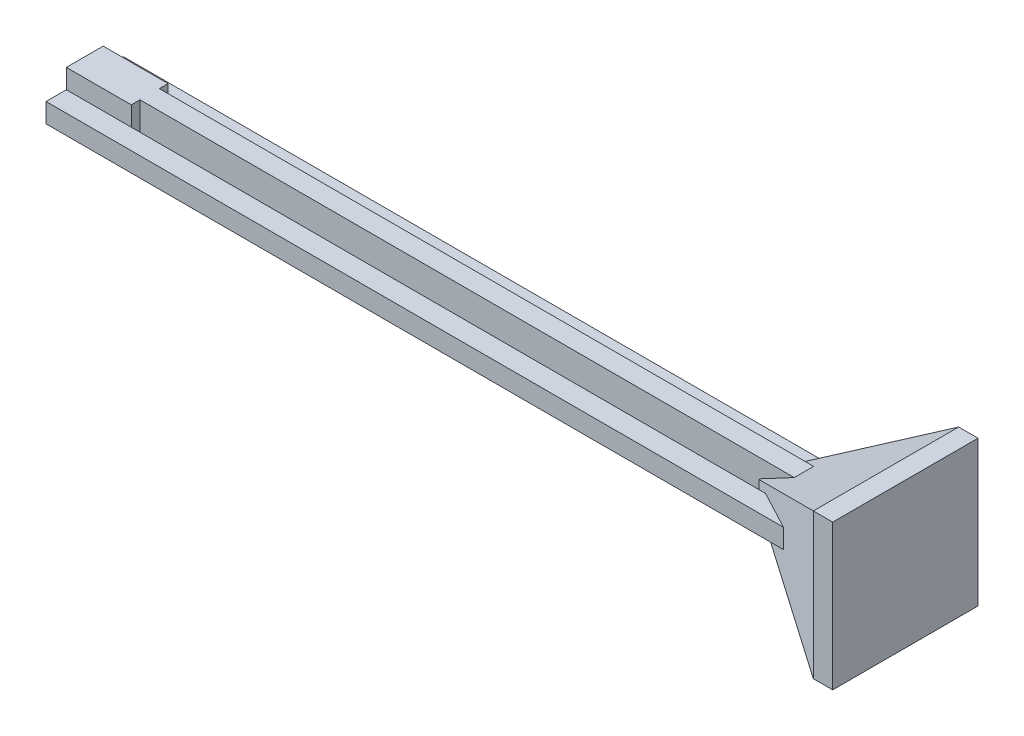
ISO-10303-21;
HEADER;
FILE_DESCRIPTION(('STEP AP214'),'2;1');
FILE_NAME('part.step','',(''),(''),'','','');
FILE_SCHEMA(('AUTOMOTIVE_DESIGN { 1 0 10303 214 1 1 1 1 }'));
ENDSEC;
DATA;
#1=APPLICATION_CONTEXT('core data for automotive mechanical design processes');
#2=APPLICATION_PROTOCOL_DEFINITION('international standard','automotive_design',2000,#1);
#3=PRODUCT_CONTEXT('',#1,'mechanical');
#4=PRODUCT('Part','Part','',(#3));
#5=PRODUCT_RELATED_PRODUCT_CATEGORY('part','',(#4));
#6=PRODUCT_DEFINITION_FORMATION('','',#4);
#7=PRODUCT_DEFINITION_CONTEXT('part definition',#1,'design');
#8=PRODUCT_DEFINITION('design','',#6,#7);
#9=PRODUCT_DEFINITION_SHAPE('','',#8);
#10=(LENGTH_UNIT() NAMED_UNIT(*) SI_UNIT(.MILLI.,.METRE.));
#11=(NAMED_UNIT(*) PLANE_ANGLE_UNIT() SI_UNIT($,.RADIAN.));
#12=(NAMED_UNIT(*) SI_UNIT($,.STERADIAN.) SOLID_ANGLE_UNIT());
#13=UNCERTAINTY_MEASURE_WITH_UNIT(LENGTH_MEASURE(1.E-05),#10,'distance_accuracy_value','');
#14=(GEOMETRIC_REPRESENTATION_CONTEXT(3) GLOBAL_UNCERTAINTY_ASSIGNED_CONTEXT((#13)) GLOBAL_UNIT_ASSIGNED_CONTEXT((#10,
#11,#12)) REPRESENTATION_CONTEXT('',''));
#15=CARTESIAN_POINT('',(0.,0.,0.));
#16=DIRECTION('',(0.,0.,1.));
#17=DIRECTION('',(1.,0.,0.));
#18=AXIS2_PLACEMENT_3D('',#15,#16,#17);
#19=CARTESIAN_POINT('',(-3.35,4.,1.9));
#20=DIRECTION('',(0.,0.,-1.));
#21=DIRECTION('',(-1.,0.,0.));
#22=AXIS2_PLACEMENT_3D('',#19,#20,#21);
#23=PLANE('',#22);
#24=DIRECTION('',(-1.,0.,0.));
#25=VECTOR('',#24,1.);
#26=CARTESIAN_POINT('',(74.65,4.,1.9));
#27=LINE('',#26,#25);
#28=CARTESIAN_POINT('',(3.35000000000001,4.,1.9));
#29=VERTEX_POINT('',#28);
#30=CARTESIAN_POINT('',(-3.35,4.,1.9));
#31=VERTEX_POINT('',#30);
#32=EDGE_CURVE('E272',#29,#31,#27,.T.);
#33=ORIENTED_EDGE('',*,*,#32,.F.);
#34=DIRECTION('',(0.,-1.,0.));
#35=VECTOR('',#34,1.);
#36=CARTESIAN_POINT('',(3.35,4.,1.9));
#37=LINE('',#36,#35);
#38=CARTESIAN_POINT('',(3.35,6.,1.9));
#39=VERTEX_POINT('',#38);
#40=EDGE_CURVE('E415',#39,#29,#37,.T.);
#41=ORIENTED_EDGE('',*,*,#40,.F.);
#42=DIRECTION('',(1.,0.,0.));
#43=VECTOR('',#42,1.);
#44=CARTESIAN_POINT('',(-7.64418211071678,6.,1.9));
#45=LINE('',#44,#43);
#46=CARTESIAN_POINT('',(-3.35,6.,1.9));
#47=VERTEX_POINT('',#46);
#48=EDGE_CURVE('E359',#47,#39,#45,.T.);
#49=ORIENTED_EDGE('',*,*,#48,.F.);
#50=DIRECTION('',(0.,-1.,0.));
#51=VECTOR('',#50,1.);
#52=CARTESIAN_POINT('',(-3.35,4.,1.9));
#53=LINE('',#52,#51);
#54=EDGE_CURVE('E419',#47,#31,#53,.T.);
#55=ORIENTED_EDGE('',*,*,#54,.T.);
#56=EDGE_LOOP('',(#33,#41,#49,#55));
#57=FACE_BOUND('',#56,.T.);
#58=ADVANCED_FACE('F32',(#57),#23,.F.);
#59=CARTESIAN_POINT('',(-3.35,4.,-1.9));
#60=DIRECTION('',(0.,0.,1.));
#61=DIRECTION('',(1.,0.,0.));
#62=AXIS2_PLACEMENT_3D('',#59,#60,#61);
#63=PLANE('',#62);
#64=DIRECTION('',(-1.,0.,0.));
#65=VECTOR('',#64,1.);
#66=CARTESIAN_POINT('',(74.65,2.,-1.9));
#67=LINE('',#66,#65);
#68=CARTESIAN_POINT('',(3.35000000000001,2.,-1.9));
#69=VERTEX_POINT('',#68);
#70=CARTESIAN_POINT('',(-3.35,2.,-1.9));
#71=VERTEX_POINT('',#70);
#72=EDGE_CURVE('E290',#69,#71,#67,.T.);
#73=ORIENTED_EDGE('',*,*,#72,.F.);
#74=DIRECTION('',(0.,-1.,0.));
#75=VECTOR('',#74,1.);
#76=CARTESIAN_POINT('',(3.35,4.,-1.9));
#77=LINE('',#76,#75);
#78=CARTESIAN_POINT('',(3.35,0.,-1.9));
#79=VERTEX_POINT('',#78);
#80=EDGE_CURVE('E426',#69,#79,#77,.T.);
#81=ORIENTED_EDGE('',*,*,#80,.T.);
#82=DIRECTION('',(-1.,0.,0.));
#83=VECTOR('',#82,1.);
#84=CARTESIAN_POINT('',(-3.35,0.,-1.9));
#85=LINE('',#84,#83);
#86=CARTESIAN_POINT('',(-3.35,0.,-1.9));
#87=VERTEX_POINT('',#86);
#88=EDGE_CURVE('E405',#79,#87,#85,.T.);
#89=ORIENTED_EDGE('',*,*,#88,.T.);
#90=DIRECTION('',(0.,-1.,0.));
#91=VECTOR('',#90,1.);
#92=CARTESIAN_POINT('',(-3.35,4.,-1.9));
#93=LINE('',#92,#91);
#94=EDGE_CURVE('E422',#71,#87,#93,.T.);
#95=ORIENTED_EDGE('',*,*,#94,.F.);
#96=EDGE_LOOP('',(#73,#81,#89,#95));
#97=FACE_BOUND('',#96,.T.);
#98=ADVANCED_FACE('F510',(#97),#63,.F.);
#99=CARTESIAN_POINT('',(3.35,4.,-1.9));
#100=DIRECTION('',(-1.,0.,0.));
#101=DIRECTION('',(0.,0.,1.));
#102=AXIS2_PLACEMENT_3D('',#99,#100,#101);
#103=PLANE('',#102);
#104=DIRECTION('',(0.,-1.,0.));
#105=VECTOR('',#104,1.);
#106=CARTESIAN_POINT('',(3.35,6.,1.));
#107=LINE('',#106,#105);
#108=CARTESIAN_POINT('',(3.35,6.,1.));
#109=VERTEX_POINT('',#108);
#110=CARTESIAN_POINT('',(3.35,0.,1.));
#111=VERTEX_POINT('',#110);
#112=EDGE_CURVE('E340',#109,#111,#107,.T.);
#113=ORIENTED_EDGE('',*,*,#112,.F.);
#114=DIRECTION('',(0.,0.,1.));
#115=VECTOR('',#114,1.);
#116=CARTESIAN_POINT('',(3.35,6.,1.9));
#117=LINE('',#116,#115);
#118=EDGE_CURVE('E354',#109,#39,#117,.T.);
#119=ORIENTED_EDGE('',*,*,#118,.T.);
#120=ORIENTED_EDGE('',*,*,#40,.T.);
#121=CARTESIAN_POINT('',(3.35000000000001,2.,1.9));
#122=VERTEX_POINT('',#121);
#123=EDGE_CURVE('E267',#29,#122,#37,.T.);
#124=ORIENTED_EDGE('',*,*,#123,.T.);
#125=CARTESIAN_POINT('',(3.35,0.,1.9));
#126=VERTEX_POINT('',#125);
#127=EDGE_CURVE('E414',#122,#126,#37,.T.);
#128=ORIENTED_EDGE('',*,*,#127,.T.);
#129=DIRECTION('',(0.,0.,-1.));
#130=VECTOR('',#129,1.);
#131=CARTESIAN_POINT('',(3.35,0.,-1.9));
#132=LINE('',#131,#130);
#133=EDGE_CURVE('E402',#126,#111,#132,.T.);
#134=ORIENTED_EDGE('',*,*,#133,.T.);
#135=EDGE_LOOP('',(#113,#119,#120,#124,#128,#134));
#136=FACE_BOUND('',#135,.T.);
#137=ADVANCED_FACE('F34',(#136),#103,.F.);
#138=DIRECTION('',(0.,1.,0.));
#139=VECTOR('',#138,1.);
#140=CARTESIAN_POINT('',(3.35,0.,-1.));
#141=LINE('',#140,#139);
#142=CARTESIAN_POINT('',(3.35,0.,-1.));
#143=VERTEX_POINT('',#142);
#144=CARTESIAN_POINT('',(3.35,6.,-1.));
#145=VERTEX_POINT('',#144);
#146=EDGE_CURVE('E343',#143,#145,#141,.T.);
#147=ORIENTED_EDGE('',*,*,#146,.F.);
#148=EDGE_CURVE('E401',#143,#79,#132,.T.);
#149=ORIENTED_EDGE('',*,*,#148,.T.);
#150=ORIENTED_EDGE('',*,*,#80,.F.);
#151=CARTESIAN_POINT('',(3.35000000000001,4.,-1.9));
#152=VERTEX_POINT('',#151);
#153=EDGE_CURVE('E298',#152,#69,#77,.T.);
#154=ORIENTED_EDGE('',*,*,#153,.F.);
#155=CARTESIAN_POINT('',(3.35,6.,-1.9));
#156=VERTEX_POINT('',#155);
#157=EDGE_CURVE('E427',#156,#152,#77,.T.);
#158=ORIENTED_EDGE('',*,*,#157,.F.);
#159=EDGE_CURVE('E360',#156,#145,#117,.T.);
#160=ORIENTED_EDGE('',*,*,#159,.T.);
#161=EDGE_LOOP('',(#147,#149,#150,#154,#158,#160));
#162=FACE_BOUND('',#161,.T.);
#163=ADVANCED_FACE('F506',(#162),#103,.F.);
#164=CARTESIAN_POINT('',(0.,0.,0.));
#165=DIRECTION('',(0.,1.,0.));
#166=DIRECTION('',(0.,0.,1.));
#167=AXIS2_PLACEMENT_3D('',#164,#165,#166);
#168=PLANE('',#167);
#169=DIRECTION('',(-1.,0.,0.));
#170=VECTOR('',#169,1.);
#171=CARTESIAN_POINT('',(79.35,0.,-1.));
#172=LINE('',#171,#170);
#173=CARTESIAN_POINT('',(70.8867309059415,0.,-1.));
#174=VERTEX_POINT('',#173);
#175=EDGE_CURVE('E350',#174,#143,#172,.T.);
#176=ORIENTED_EDGE('',*,*,#175,.F.);
#177=DIRECTION('',(0.,0.,1.));
#178=VECTOR('',#177,1.);
#179=CARTESIAN_POINT('',(70.8867309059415,0.,0.));
#180=LINE('',#179,#178);
#181=CARTESIAN_POINT('',(70.8867309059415,0.,1.));
#182=VERTEX_POINT('',#181);
#183=EDGE_CURVE('E336',#174,#182,#180,.T.);
#184=ORIENTED_EDGE('',*,*,#183,.T.);
#185=DIRECTION('',(-1.,0.,0.));
#186=VECTOR('',#185,1.);
#187=CARTESIAN_POINT('',(79.35,0.,1.));
#188=LINE('',#187,#186);
#189=EDGE_CURVE('E352',#182,#111,#188,.T.);
#190=ORIENTED_EDGE('',*,*,#189,.T.);
#191=ORIENTED_EDGE('',*,*,#133,.F.);
#192=DIRECTION('',(1.,0.,0.));
#193=VECTOR('',#192,1.);
#194=CARTESIAN_POINT('',(-3.35,0.,1.9));
#195=LINE('',#194,#193);
#196=CARTESIAN_POINT('',(-3.35,0.,1.9));
#197=VERTEX_POINT('',#196);
#198=EDGE_CURVE('E411',#197,#126,#195,.T.);
#199=ORIENTED_EDGE('',*,*,#198,.F.);
#200=DIRECTION('',(0.,0.,1.));
#201=VECTOR('',#200,1.);
#202=CARTESIAN_POINT('',(-3.35,0.,-1.9));
#203=LINE('',#202,#201);
#204=EDGE_CURVE('E408',#87,#197,#203,.T.);
#205=ORIENTED_EDGE('',*,*,#204,.F.);
#206=ORIENTED_EDGE('',*,*,#88,.F.);
#207=ORIENTED_EDGE('',*,*,#148,.F.);
#208=EDGE_LOOP('',(#176,#184,#190,#191,#199,#205,#206,#207));
#209=FACE_BOUND('',#208,.T.);
#210=DIRECTION('',(0.,0.,-1.));
#211=VECTOR('',#210,1.);
#212=CARTESIAN_POINT('',(2.15,0.,-0.7));
#213=LINE('',#212,#211);
#214=CARTESIAN_POINT('',(2.15,0.,0.7));
#215=VERTEX_POINT('',#214);
#216=CARTESIAN_POINT('',(2.15,0.,-0.7));
#217=VERTEX_POINT('',#216);
#218=EDGE_CURVE('E358',#215,#217,#213,.T.);
#219=ORIENTED_EDGE('',*,*,#218,.T.);
#220=DIRECTION('',(-1.,0.,0.));
#221=VECTOR('',#220,1.);
#222=CARTESIAN_POINT('',(-2.15,0.,-0.7));
#223=LINE('',#222,#221);
#224=CARTESIAN_POINT('',(-2.15,0.,-0.7));
#225=VERTEX_POINT('',#224);
#226=EDGE_CURVE('E384',#217,#225,#223,.T.);
#227=ORIENTED_EDGE('',*,*,#226,.T.);
#228=DIRECTION('',(0.,0.,1.));
#229=VECTOR('',#228,1.);
#230=CARTESIAN_POINT('',(-2.15,0.,-0.7));
#231=LINE('',#230,#229);
#232=CARTESIAN_POINT('',(-2.15,0.,0.7));
#233=VERTEX_POINT('',#232);
#234=EDGE_CURVE('E387',#225,#233,#231,.T.);
#235=ORIENTED_EDGE('',*,*,#234,.T.);
#236=DIRECTION('',(1.,0.,0.));
#237=VECTOR('',#236,1.);
#238=CARTESIAN_POINT('',(-2.15,0.,0.7));
#239=LINE('',#238,#237);
#240=EDGE_CURVE('E372',#233,#215,#239,.T.);
#241=ORIENTED_EDGE('',*,*,#240,.T.);
#242=EDGE_LOOP('',(#219,#227,#235,#241));
#243=FACE_BOUND('',#242,.T.);
#244=ADVANCED_FACE('F516',(#209,#243),#168,.F.);
#245=ORIENTED_EDGE('',*,*,#157,.T.);
#246=DIRECTION('',(-1.,0.,0.));
#247=VECTOR('',#246,1.);
#248=CARTESIAN_POINT('',(74.65,4.,-1.9));
#249=LINE('',#248,#247);
#250=CARTESIAN_POINT('',(-3.35,4.,-1.9));
#251=VERTEX_POINT('',#250);
#252=EDGE_CURVE('E285',#152,#251,#249,.T.);
#253=ORIENTED_EDGE('',*,*,#252,.T.);
#254=CARTESIAN_POINT('',(-3.35,6.,-1.9));
#255=VERTEX_POINT('',#254);
#256=EDGE_CURVE('E423',#255,#251,#93,.T.);
#257=ORIENTED_EDGE('',*,*,#256,.F.);
#258=DIRECTION('',(1.,0.,0.));
#259=VECTOR('',#258,1.);
#260=CARTESIAN_POINT('',(-7.64418211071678,6.,-1.9));
#261=LINE('',#260,#259);
#262=EDGE_CURVE('E363',#255,#156,#261,.T.);
#263=ORIENTED_EDGE('',*,*,#262,.T.);
#264=EDGE_LOOP('',(#245,#253,#257,#263));
#265=FACE_BOUND('',#264,.T.);
#266=ADVANCED_FACE('F493',(#265),#63,.F.);
#267=CARTESIAN_POINT('',(-3.35,4.,-1.9));
#268=DIRECTION('',(1.,0.,0.));
#269=DIRECTION('',(0.,0.,-1.));
#270=AXIS2_PLACEMENT_3D('',#267,#268,#269);
#271=PLANE('',#270);
#272=ORIENTED_EDGE('',*,*,#204,.T.);
#273=CARTESIAN_POINT('',(-3.35,2.,1.9));
#274=VERTEX_POINT('',#273);
#275=EDGE_CURVE('E418',#274,#197,#53,.T.);
#276=ORIENTED_EDGE('',*,*,#275,.F.);
#277=DIRECTION('',(0.,0.,1.));
#278=VECTOR('',#277,1.);
#279=CARTESIAN_POINT('',(-3.35,2.,4.));
#280=LINE('',#279,#278);
#281=CARTESIAN_POINT('',(-3.35,2.,4.));
#282=VERTEX_POINT('',#281);
#283=EDGE_CURVE('E47',#274,#282,#280,.T.);
#284=ORIENTED_EDGE('',*,*,#283,.T.);
#285=DIRECTION('',(0.,1.,0.));
#286=VECTOR('',#285,1.);
#287=CARTESIAN_POINT('',(-3.35,2.,4.));
#288=LINE('',#287,#286);
#289=CARTESIAN_POINT('',(-3.35,4.,4.));
#290=VERTEX_POINT('',#289);
#291=EDGE_CURVE('E252',#282,#290,#288,.T.);
#292=ORIENTED_EDGE('',*,*,#291,.T.);
#293=DIRECTION('',(0.,0.,-1.));
#294=VECTOR('',#293,1.);
#295=CARTESIAN_POINT('',(-3.35,4.,4.));
#296=LINE('',#295,#294);
#297=EDGE_CURVE('E255',#290,#31,#296,.T.);
#298=ORIENTED_EDGE('',*,*,#297,.T.);
#299=ORIENTED_EDGE('',*,*,#54,.F.);
#300=DIRECTION('',(0.,0.,-1.));
#301=VECTOR('',#300,1.);
#302=CARTESIAN_POINT('',(-3.35,6.,1.9));
#303=LINE('',#302,#301);
#304=EDGE_CURVE('E355',#47,#255,#303,.T.);
#305=ORIENTED_EDGE('',*,*,#304,.T.);
#306=ORIENTED_EDGE('',*,*,#256,.T.);
#307=DIRECTION('',(0.,0.,-1.));
#308=VECTOR('',#307,1.);
#309=CARTESIAN_POINT('',(-3.35,4.,-1.9));
#310=LINE('',#309,#308);
#311=CARTESIAN_POINT('',(-3.35,4.,-4.));
#312=VERTEX_POINT('',#311);
#313=EDGE_CURVE('E275',#251,#312,#310,.T.);
#314=ORIENTED_EDGE('',*,*,#313,.T.);
#315=DIRECTION('',(0.,-1.,0.));
#316=VECTOR('',#315,1.);
#317=CARTESIAN_POINT('',(-3.35,2.,-4.));
#318=LINE('',#317,#316);
#319=CARTESIAN_POINT('',(-3.35,2.,-4.));
#320=VERTEX_POINT('',#319);
#321=EDGE_CURVE('E278',#312,#320,#318,.T.);
#322=ORIENTED_EDGE('',*,*,#321,.T.);
#323=DIRECTION('',(0.,0.,1.));
#324=VECTOR('',#323,1.);
#325=CARTESIAN_POINT('',(-3.35,2.,-1.9));
#326=LINE('',#325,#324);
#327=EDGE_CURVE('E281',#320,#71,#326,.T.);
#328=ORIENTED_EDGE('',*,*,#327,.T.);
#329=ORIENTED_EDGE('',*,*,#94,.T.);
#330=EDGE_LOOP('',(#272,#276,#284,#292,#298,#299,#305,#306,#314,#322,#328,#329));
#331=FACE_BOUND('',#330,.T.);
#332=ADVANCED_FACE('F465',(#331),#271,.F.);
#333=ORIENTED_EDGE('',*,*,#127,.F.);
#334=DIRECTION('',(-1.,0.,0.));
#335=VECTOR('',#334,1.);
#336=CARTESIAN_POINT('',(74.65,2.,1.9));
#337=LINE('',#336,#335);
#338=EDGE_CURVE('E269',#122,#274,#337,.T.);
#339=ORIENTED_EDGE('',*,*,#338,.T.);
#340=ORIENTED_EDGE('',*,*,#275,.T.);
#341=ORIENTED_EDGE('',*,*,#198,.T.);
#342=EDGE_LOOP('',(#333,#339,#340,#341));
#343=FACE_BOUND('',#342,.T.);
#344=ADVANCED_FACE('F470',(#343),#23,.F.);
#345=CARTESIAN_POINT('',(2.15,4.,-0.7));
#346=DIRECTION('',(-1.,0.,0.));
#347=DIRECTION('',(0.,0.,1.));
#348=AXIS2_PLACEMENT_3D('',#345,#346,#347);
#349=PLANE('',#348);
#350=ORIENTED_EDGE('',*,*,#218,.F.);
#351=DIRECTION('',(0.,-1.,0.));
#352=VECTOR('',#351,1.);
#353=CARTESIAN_POINT('',(2.15,4.,0.7));
#354=LINE('',#353,#352);
#355=CARTESIAN_POINT('',(2.15,4.,0.7));
#356=VERTEX_POINT('',#355);
#357=EDGE_CURVE('E381',#356,#215,#354,.T.);
#358=ORIENTED_EDGE('',*,*,#357,.F.);
#359=DIRECTION('',(0.,0.,-1.));
#360=VECTOR('',#359,1.);
#361=CARTESIAN_POINT('',(2.15,4.,-0.7));
#362=LINE('',#361,#360);
#363=CARTESIAN_POINT('',(2.15,4.,-0.7));
#364=VERTEX_POINT('',#363);
#365=EDGE_CURVE('E368',#356,#364,#362,.T.);
#366=ORIENTED_EDGE('',*,*,#365,.T.);
#367=DIRECTION('',(0.,-1.,0.));
#368=VECTOR('',#367,1.);
#369=CARTESIAN_POINT('',(2.15,4.,-0.7));
#370=LINE('',#369,#368);
#371=EDGE_CURVE('E398',#364,#217,#370,.T.);
#372=ORIENTED_EDGE('',*,*,#371,.T.);
#373=EDGE_LOOP('',(#350,#358,#366,#372));
#374=FACE_BOUND('',#373,.T.);
#375=ADVANCED_FACE('F578',(#374),#349,.T.);
#376=CARTESIAN_POINT('',(-2.15,4.,-0.7));
#377=DIRECTION('',(0.,0.,1.));
#378=DIRECTION('',(1.,0.,0.));
#379=AXIS2_PLACEMENT_3D('',#376,#377,#378);
#380=PLANE('',#379);
#381=ORIENTED_EDGE('',*,*,#226,.F.);
#382=ORIENTED_EDGE('',*,*,#371,.F.);
#383=DIRECTION('',(-1.,0.,0.));
#384=VECTOR('',#383,1.);
#385=CARTESIAN_POINT('',(-2.15,4.,-0.7));
#386=LINE('',#385,#384);
#387=CARTESIAN_POINT('',(-2.15,4.,-0.7));
#388=VERTEX_POINT('',#387);
#389=EDGE_CURVE('E371',#364,#388,#386,.T.);
#390=ORIENTED_EDGE('',*,*,#389,.T.);
#391=DIRECTION('',(0.,-1.,0.));
#392=VECTOR('',#391,1.);
#393=CARTESIAN_POINT('',(-2.15,4.,-0.7));
#394=LINE('',#393,#392);
#395=EDGE_CURVE('E396',#388,#225,#394,.T.);
#396=ORIENTED_EDGE('',*,*,#395,.T.);
#397=EDGE_LOOP('',(#381,#382,#390,#396));
#398=FACE_BOUND('',#397,.T.);
#399=ADVANCED_FACE('F583',(#398),#380,.T.);
#400=CARTESIAN_POINT('',(-2.15,4.,-0.7));
#401=DIRECTION('',(1.,0.,0.));
#402=DIRECTION('',(0.,0.,-1.));
#403=AXIS2_PLACEMENT_3D('',#400,#401,#402);
#404=PLANE('',#403);
#405=ORIENTED_EDGE('',*,*,#234,.F.);
#406=ORIENTED_EDGE('',*,*,#395,.F.);
#407=DIRECTION('',(0.,0.,1.));
#408=VECTOR('',#407,1.);
#409=CARTESIAN_POINT('',(-2.15,4.,-0.7));
#410=LINE('',#409,#408);
#411=CARTESIAN_POINT('',(-2.15,4.,0.7));
#412=VERTEX_POINT('',#411);
#413=EDGE_CURVE('E375',#388,#412,#410,.T.);
#414=ORIENTED_EDGE('',*,*,#413,.T.);
#415=DIRECTION('',(0.,-1.,0.));
#416=VECTOR('',#415,1.);
#417=CARTESIAN_POINT('',(-2.15,4.,0.7));
#418=LINE('',#417,#416);
#419=EDGE_CURVE('E394',#412,#233,#418,.T.);
#420=ORIENTED_EDGE('',*,*,#419,.T.);
#421=EDGE_LOOP('',(#405,#406,#414,#420));
#422=FACE_BOUND('',#421,.T.);
#423=ADVANCED_FACE('F598',(#422),#404,.T.);
#424=CARTESIAN_POINT('',(-2.15,4.,0.7));
#425=DIRECTION('',(0.,0.,-1.));
#426=DIRECTION('',(-1.,0.,0.));
#427=AXIS2_PLACEMENT_3D('',#424,#425,#426);
#428=PLANE('',#427);
#429=ORIENTED_EDGE('',*,*,#240,.F.);
#430=ORIENTED_EDGE('',*,*,#419,.F.);
#431=DIRECTION('',(1.,0.,0.));
#432=VECTOR('',#431,1.);
#433=CARTESIAN_POINT('',(-2.15,4.,0.7));
#434=LINE('',#433,#432);
#435=EDGE_CURVE('E378',#412,#356,#434,.T.);
#436=ORIENTED_EDGE('',*,*,#435,.T.);
#437=ORIENTED_EDGE('',*,*,#357,.T.);
#438=EDGE_LOOP('',(#429,#430,#436,#437));
#439=FACE_BOUND('',#438,.T.);
#440=ADVANCED_FACE('F602',(#439),#428,.T.);
#441=CARTESIAN_POINT('',(-7.64418211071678,4.,1.9));
#442=DIRECTION('',(0.,-1.,0.));
#443=DIRECTION('',(0.,0.,-1.));
#444=AXIS2_PLACEMENT_3D('',#441,#442,#443);
#445=PLANE('',#444);
#446=ORIENTED_EDGE('',*,*,#389,.F.);
#447=ORIENTED_EDGE('',*,*,#365,.F.);
#448=ORIENTED_EDGE('',*,*,#435,.F.);
#449=ORIENTED_EDGE('',*,*,#413,.F.);
#450=EDGE_LOOP('',(#446,#447,#448,#449));
#451=FACE_BOUND('',#450,.T.);
#452=ADVANCED_FACE('F606',(#451),#445,.T.);
#453=CARTESIAN_POINT('',(-7.64418211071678,6.,1.9));
#454=DIRECTION('',(0.,1.,0.));
#455=DIRECTION('',(0.,0.,1.));
#456=AXIS2_PLACEMENT_3D('',#453,#454,#455);
#457=PLANE('',#456);
#458=DIRECTION('',(0.,0.,1.));
#459=VECTOR('',#458,1.);
#460=CARTESIAN_POINT('',(70.8867309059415,6.,1.9));
#461=LINE('',#460,#459);
#462=CARTESIAN_POINT('',(70.8867309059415,6.,-1.));
#463=VERTEX_POINT('',#462);
#464=CARTESIAN_POINT('',(70.8867309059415,6.,1.));
#465=VERTEX_POINT('',#464);
#466=EDGE_CURVE('E331',#463,#465,#461,.T.);
#467=ORIENTED_EDGE('',*,*,#466,.F.);
#468=DIRECTION('',(-1.,0.,0.));
#469=VECTOR('',#468,1.);
#470=CARTESIAN_POINT('',(79.35,6.,-1.));
#471=LINE('',#470,#469);
#472=EDGE_CURVE('E348',#463,#145,#471,.T.);
#473=ORIENTED_EDGE('',*,*,#472,.T.);
#474=ORIENTED_EDGE('',*,*,#159,.F.);
#475=ORIENTED_EDGE('',*,*,#262,.F.);
#476=ORIENTED_EDGE('',*,*,#304,.F.);
#477=ORIENTED_EDGE('',*,*,#48,.T.);
#478=ORIENTED_EDGE('',*,*,#118,.F.);
#479=DIRECTION('',(-1.,0.,0.));
#480=VECTOR('',#479,1.);
#481=CARTESIAN_POINT('',(79.35,6.,1.));
#482=LINE('',#481,#480);
#483=EDGE_CURVE('E346',#465,#109,#482,.T.);
#484=ORIENTED_EDGE('',*,*,#483,.F.);
#485=EDGE_LOOP('',(#467,#473,#474,#475,#476,#477,#478,#484));
#486=FACE_BOUND('',#485,.T.);
#487=ADVANCED_FACE('F488',(#486),#457,.T.);
#488=CARTESIAN_POINT('',(79.35,6.,1.));
#489=DIRECTION('',(0.,0.,-1.));
#490=DIRECTION('',(-1.,0.,0.));
#491=AXIS2_PLACEMENT_3D('',#488,#489,#490);
#492=PLANE('',#491);
#493=ORIENTED_EDGE('',*,*,#189,.F.);
#494=DIRECTION('',(-0.882947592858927,0.469471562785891,0.));
#495=VECTOR('',#494,1.);
#496=CARTESIAN_POINT('',(74.997552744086,-2.18576274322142,1.));
#497=LINE('',#496,#495);
#498=CARTESIAN_POINT('',(67.35,1.88051317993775,1.));
#499=VERTEX_POINT('',#498);
#500=EDGE_CURVE('E338',#182,#499,#497,.T.);
#501=ORIENTED_EDGE('',*,*,#500,.T.);
#502=DIRECTION('',(0.,-1.,0.));
#503=VECTOR('',#502,1.);
#504=CARTESIAN_POINT('',(67.35,6.,1.));
#505=LINE('',#504,#503);
#506=CARTESIAN_POINT('',(67.35,4.11948682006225,1.));
#507=VERTEX_POINT('',#506);
#508=EDGE_CURVE('E309',#507,#499,#505,.T.);
#509=ORIENTED_EDGE('',*,*,#508,.F.);
#510=DIRECTION('',(0.882947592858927,0.469471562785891,0.));
#511=VECTOR('',#510,1.);
#512=CARTESIAN_POINT('',(77.4846654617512,9.50818403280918,1.));
#513=LINE('',#512,#511);
#514=EDGE_CURVE('E334',#507,#465,#513,.T.);
#515=ORIENTED_EDGE('',*,*,#514,.T.);
#516=ORIENTED_EDGE('',*,*,#483,.T.);
#517=ORIENTED_EDGE('',*,*,#112,.T.);
#518=EDGE_LOOP('',(#493,#501,#509,#515,#516,#517));
#519=FACE_BOUND('',#518,.T.);
#520=ADVANCED_FACE('F522',(#519),#492,.F.);
#521=CARTESIAN_POINT('',(79.35,0.,-1.));
#522=DIRECTION('',(0.,0.,1.));
#523=DIRECTION('',(1.,0.,0.));
#524=AXIS2_PLACEMENT_3D('',#521,#522,#523);
#525=PLANE('',#524);
#526=DIRECTION('',(0.,1.,0.));
#527=VECTOR('',#526,1.);
#528=CARTESIAN_POINT('',(67.35,0.,-1.));
#529=LINE('',#528,#527);
#530=CARTESIAN_POINT('',(67.35,1.88051317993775,-1.));
#531=VERTEX_POINT('',#530);
#532=CARTESIAN_POINT('',(67.35,4.11948682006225,-1.));
#533=VERTEX_POINT('',#532);
#534=EDGE_CURVE('E430',#531,#533,#529,.T.);
#535=ORIENTED_EDGE('',*,*,#534,.F.);
#536=DIRECTION('',(0.882947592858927,-0.469471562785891,0.));
#537=VECTOR('',#536,1.);
#538=CARTESIAN_POINT('',(77.4846654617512,-3.50818403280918,-1.));
#539=LINE('',#538,#537);
#540=EDGE_CURVE('E435',#531,#174,#539,.T.);
#541=ORIENTED_EDGE('',*,*,#540,.T.);
#542=ORIENTED_EDGE('',*,*,#175,.T.);
#543=ORIENTED_EDGE('',*,*,#146,.T.);
#544=ORIENTED_EDGE('',*,*,#472,.F.);
#545=DIRECTION('',(-0.882947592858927,-0.469471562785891,0.));
#546=VECTOR('',#545,1.);
#547=CARTESIAN_POINT('',(74.997552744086,8.18576274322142,-1.));
#548=LINE('',#547,#546);
#549=EDGE_CURVE('E433',#463,#533,#548,.T.);
#550=ORIENTED_EDGE('',*,*,#549,.T.);
#551=EDGE_LOOP('',(#535,#541,#542,#543,#544,#550));
#552=FACE_BOUND('',#551,.T.);
#553=ADVANCED_FACE('F532',(#552),#525,.F.);
#554=CARTESIAN_POINT('',(79.35,-4.5,7.5));
#555=DIRECTION('',(-0.469471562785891,-0.882947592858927,0.));
#556=DIRECTION('',(0.882947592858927,-0.469471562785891,0.));
#557=AXIS2_PLACEMENT_3D('',#554,#555,#556);
#558=PLANE('',#557);
#559=ORIENTED_EDGE('',*,*,#500,.F.);
#560=ORIENTED_EDGE('',*,*,#183,.F.);
#561=ORIENTED_EDGE('',*,*,#540,.F.);
#562=DIRECTION('',(0.,0.,-1.));
#563=VECTOR('',#562,1.);
#564=CARTESIAN_POINT('',(67.35,1.88051317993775,0.));
#565=LINE('',#564,#563);
#566=CARTESIAN_POINT('',(67.35,1.88051317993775,-1.11948682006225));
#567=VERTEX_POINT('',#566);
#568=EDGE_CURVE('E322',#531,#567,#565,.T.);
#569=ORIENTED_EDGE('',*,*,#568,.T.);
#570=DIRECTION('',(0.799251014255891,-0.42496930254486,-0.42496930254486));
#571=VECTOR('',#570,1.);
#572=CARTESIAN_POINT('',(74.255142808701,-1.79101637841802,-4.79101637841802));
#573=LINE('',#572,#571);
#574=CARTESIAN_POINT('',(79.35,-4.5,-7.5));
#575=VERTEX_POINT('',#574);
#576=EDGE_CURVE('E306',#567,#575,#573,.T.);
#577=ORIENTED_EDGE('',*,*,#576,.T.);
#578=DIRECTION('',(0.,0.,-1.));
#579=VECTOR('',#578,1.);
#580=CARTESIAN_POINT('',(79.35,-4.5,7.5));
#581=LINE('',#580,#579);
#582=CARTESIAN_POINT('',(79.35,-4.5,7.5));
#583=VERTEX_POINT('',#582);
#584=EDGE_CURVE('E251',#583,#575,#581,.T.);
#585=ORIENTED_EDGE('',*,*,#584,.F.);
#586=DIRECTION('',(0.799251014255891,-0.42496930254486,0.42496930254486));
#587=VECTOR('',#586,1.);
#588=CARTESIAN_POINT('',(74.255142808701,-1.79101637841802,4.79101637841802));
#589=LINE('',#588,#587);
#590=CARTESIAN_POINT('',(67.35,1.88051317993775,1.11948682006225));
#591=VERTEX_POINT('',#590);
#592=EDGE_CURVE('E310',#591,#583,#589,.T.);
#593=ORIENTED_EDGE('',*,*,#592,.F.);
#594=EDGE_CURVE('E314',#591,#499,#565,.T.);
#595=ORIENTED_EDGE('',*,*,#594,.T.);
#596=EDGE_LOOP('',(#559,#560,#561,#569,#577,#585,#593,#595));
#597=FACE_BOUND('',#596,.T.);
#598=ADVANCED_FACE('F540',(#597),#558,.T.);
#599=CARTESIAN_POINT('',(79.35,10.5,7.5));
#600=DIRECTION('',(-0.469471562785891,0.882947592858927,0.));
#601=DIRECTION('',(-0.882947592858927,-0.469471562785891,0.));
#602=AXIS2_PLACEMENT_3D('',#599,#600,#601);
#603=PLANE('',#602);
#604=ORIENTED_EDGE('',*,*,#514,.F.);
#605=DIRECTION('',(0.,0.,1.));
#606=VECTOR('',#605,1.);
#607=CARTESIAN_POINT('',(67.35,4.11948682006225,0.));
#608=LINE('',#607,#606);
#609=CARTESIAN_POINT('',(67.35,4.11948682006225,1.11948682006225));
#610=VERTEX_POINT('',#609);
#611=EDGE_CURVE('E319',#507,#610,#608,.T.);
#612=ORIENTED_EDGE('',*,*,#611,.T.);
#613=DIRECTION('',(0.799251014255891,0.42496930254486,0.42496930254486));
#614=VECTOR('',#613,1.);
#615=CARTESIAN_POINT('',(79.35,10.5,7.5));
#616=LINE('',#615,#614);
#617=CARTESIAN_POINT('',(79.35,10.5,7.5));
#618=VERTEX_POINT('',#617);
#619=EDGE_CURVE('E313',#610,#618,#616,.T.);
#620=ORIENTED_EDGE('',*,*,#619,.T.);
#621=DIRECTION('',(0.,0.,1.));
#622=VECTOR('',#621,1.);
#623=CARTESIAN_POINT('',(79.35,10.5,7.5));
#624=LINE('',#623,#622);
#625=CARTESIAN_POINT('',(79.35,10.5,-7.5));
#626=VERTEX_POINT('',#625);
#627=EDGE_CURVE('E297',#626,#618,#624,.T.);
#628=ORIENTED_EDGE('',*,*,#627,.F.);
#629=DIRECTION('',(0.799251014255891,0.42496930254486,-0.42496930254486));
#630=VECTOR('',#629,1.);
#631=CARTESIAN_POINT('',(79.35,10.5,-7.5));
#632=LINE('',#631,#630);
#633=CARTESIAN_POINT('',(67.35,4.11948682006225,-1.11948682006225));
#634=VERTEX_POINT('',#633);
#635=EDGE_CURVE('E311',#634,#626,#632,.T.);
#636=ORIENTED_EDGE('',*,*,#635,.F.);
#637=EDGE_CURVE('E326',#634,#533,#608,.T.);
#638=ORIENTED_EDGE('',*,*,#637,.T.);
#639=ORIENTED_EDGE('',*,*,#549,.F.);
#640=ORIENTED_EDGE('',*,*,#466,.T.);
#641=EDGE_LOOP('',(#604,#612,#620,#628,#636,#638,#639,#640));
#642=FACE_BOUND('',#641,.T.);
#643=ADVANCED_FACE('F528',(#642),#603,.T.);
#644=CARTESIAN_POINT('',(67.35,0.,0.));
#645=DIRECTION('',(1.,0.,0.));
#646=DIRECTION('',(0.,0.,-1.));
#647=AXIS2_PLACEMENT_3D('',#644,#645,#646);
#648=PLANE('',#647);
#649=ORIENTED_EDGE('',*,*,#611,.F.);
#650=ORIENTED_EDGE('',*,*,#508,.T.);
#651=ORIENTED_EDGE('',*,*,#594,.F.);
#652=DIRECTION('',(0.,-1.,0.));
#653=VECTOR('',#652,1.);
#654=CARTESIAN_POINT('',(67.35,0.,1.11948682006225));
#655=LINE('',#654,#653);
#656=EDGE_CURVE('E323',#610,#591,#655,.T.);
#657=ORIENTED_EDGE('',*,*,#656,.F.);
#658=EDGE_LOOP('',(#649,#650,#651,#657));
#659=FACE_BOUND('',#658,.T.);
#660=ADVANCED_FACE('F560',(#659),#648,.F.);
#661=ORIENTED_EDGE('',*,*,#568,.F.);
#662=ORIENTED_EDGE('',*,*,#534,.T.);
#663=ORIENTED_EDGE('',*,*,#637,.F.);
#664=DIRECTION('',(0.,1.,0.));
#665=VECTOR('',#664,1.);
#666=CARTESIAN_POINT('',(67.35,0.,-1.11948682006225));
#667=LINE('',#666,#665);
#668=EDGE_CURVE('E305',#567,#634,#667,.T.);
#669=ORIENTED_EDGE('',*,*,#668,.F.);
#670=EDGE_LOOP('',(#661,#662,#663,#669));
#671=FACE_BOUND('',#670,.T.);
#672=ADVANCED_FACE('F536',(#671),#648,.F.);
#673=CARTESIAN_POINT('',(79.35,10.5,-7.5));
#674=DIRECTION('',(-0.469471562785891,0.,-0.882947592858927));
#675=DIRECTION('',(-0.882947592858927,0.,0.469471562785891));
#676=AXIS2_PLACEMENT_3D('',#673,#674,#675);
#677=PLANE('',#676);
#678=DIRECTION('',(0.882947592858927,0.,-0.469471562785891));
#679=VECTOR('',#678,1.);
#680=CARTESIAN_POINT('',(79.35,4.,-7.5));
#681=LINE('',#680,#679);
#682=CARTESIAN_POINT('',(68.8179317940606,4.,-1.9));
#683=VERTEX_POINT('',#682);
#684=CARTESIAN_POINT('',(72.7674573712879,4.,-4.));
#685=VERTEX_POINT('',#684);
#686=EDGE_CURVE('E446',#683,#685,#681,.T.);
#687=ORIENTED_EDGE('',*,*,#686,.F.);
#688=DIRECTION('',(0.,1.,0.));
#689=VECTOR('',#688,1.);
#690=CARTESIAN_POINT('',(68.8179317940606,10.5,-1.9));
#691=LINE('',#690,#689);
#692=CARTESIAN_POINT('',(68.8179317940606,2.,-1.9));
#693=VERTEX_POINT('',#692);
#694=EDGE_CURVE('E443',#693,#683,#691,.T.);
#695=ORIENTED_EDGE('',*,*,#694,.F.);
#696=DIRECTION('',(-0.882947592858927,0.,0.469471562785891));
#697=VECTOR('',#696,1.);
#698=CARTESIAN_POINT('',(79.35,2.,-7.5));
#699=LINE('',#698,#697);
#700=CARTESIAN_POINT('',(72.7674573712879,2.,-4.));
#701=VERTEX_POINT('',#700);
#702=EDGE_CURVE('E440',#701,#693,#699,.T.);
#703=ORIENTED_EDGE('',*,*,#702,.F.);
#704=DIRECTION('',(0.,-1.,0.));
#705=VECTOR('',#704,1.);
#706=CARTESIAN_POINT('',(72.7674573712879,10.5,-4.));
#707=LINE('',#706,#705);
#708=EDGE_CURVE('E437',#685,#701,#707,.T.);
#709=ORIENTED_EDGE('',*,*,#708,.F.);
#710=EDGE_LOOP('',(#687,#695,#703,#709));
#711=FACE_BOUND('',#710,.T.);
#712=DIRECTION('',(0.,1.,0.));
#713=VECTOR('',#712,1.);
#714=CARTESIAN_POINT('',(79.35,10.5,-7.5));
#715=LINE('',#714,#713);
#716=EDGE_CURVE('E295',#575,#626,#715,.T.);
#717=ORIENTED_EDGE('',*,*,#716,.F.);
#718=ORIENTED_EDGE('',*,*,#576,.F.);
#719=ORIENTED_EDGE('',*,*,#668,.T.);
#720=ORIENTED_EDGE('',*,*,#635,.T.);
#721=EDGE_LOOP('',(#717,#718,#719,#720));
#722=FACE_BOUND('',#721,.T.);
#723=ADVANCED_FACE('F543',(#711,#722),#677,.T.);
#724=CARTESIAN_POINT('',(79.35,10.5,7.5));
#725=DIRECTION('',(-0.469471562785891,0.,0.882947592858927));
#726=DIRECTION('',(0.882947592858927,0.,0.469471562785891));
#727=AXIS2_PLACEMENT_3D('',#724,#725,#726);
#728=PLANE('',#727);
#729=DIRECTION('',(0.,1.,0.));
#730=VECTOR('',#729,1.);
#731=CARTESIAN_POINT('',(72.7674573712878,10.5,4.));
#732=LINE('',#731,#730);
#733=CARTESIAN_POINT('',(72.7674573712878,2.,4.));
#734=VERTEX_POINT('',#733);
#735=CARTESIAN_POINT('',(72.7674573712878,4.,4.));
#736=VERTEX_POINT('',#735);
#737=EDGE_CURVE('E11',#734,#736,#732,.T.);
#738=ORIENTED_EDGE('',*,*,#737,.F.);
#739=DIRECTION('',(0.882947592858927,0.,0.469471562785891));
#740=VECTOR('',#739,1.);
#741=CARTESIAN_POINT('',(79.35,2.,7.5));
#742=LINE('',#741,#740);
#743=CARTESIAN_POINT('',(68.8179317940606,2.,1.9));
#744=VERTEX_POINT('',#743);
#745=EDGE_CURVE('E40',#744,#734,#742,.T.);
#746=ORIENTED_EDGE('',*,*,#745,.F.);
#747=DIRECTION('',(0.,-1.,0.));
#748=VECTOR('',#747,1.);
#749=CARTESIAN_POINT('',(68.8179317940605,10.5,1.9));
#750=LINE('',#749,#748);
#751=CARTESIAN_POINT('',(68.8179317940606,4.,1.9));
#752=VERTEX_POINT('',#751);
#753=EDGE_CURVE('E452',#752,#744,#750,.T.);
#754=ORIENTED_EDGE('',*,*,#753,.F.);
#755=DIRECTION('',(-0.882947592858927,0.,-0.469471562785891));
#756=VECTOR('',#755,1.);
#757=CARTESIAN_POINT('',(79.35,4.,7.5));
#758=LINE('',#757,#756);
#759=EDGE_CURVE('E449',#736,#752,#758,.T.);
#760=ORIENTED_EDGE('',*,*,#759,.F.);
#761=EDGE_LOOP('',(#738,#746,#754,#760));
#762=FACE_BOUND('',#761,.T.);
#763=DIRECTION('',(0.,-1.,0.));
#764=VECTOR('',#763,1.);
#765=CARTESIAN_POINT('',(79.35,10.5,7.5));
#766=LINE('',#765,#764);
#767=EDGE_CURVE('E301',#618,#583,#766,.T.);
#768=ORIENTED_EDGE('',*,*,#767,.F.);
#769=ORIENTED_EDGE('',*,*,#619,.F.);
#770=ORIENTED_EDGE('',*,*,#656,.T.);
#771=ORIENTED_EDGE('',*,*,#592,.T.);
#772=EDGE_LOOP('',(#768,#769,#770,#771));
#773=FACE_BOUND('',#772,.T.);
#774=ADVANCED_FACE('F477',(#762,#773),#728,.T.);
#775=CARTESIAN_POINT('',(74.65,4.,-1.9));
#776=DIRECTION('',(0.,1.,0.));
#777=DIRECTION('',(0.,0.,1.));
#778=AXIS2_PLACEMENT_3D('',#775,#776,#777);
#779=PLANE('',#778);
#780=EDGE_CURVE('E288',#683,#152,#249,.T.);
#781=ORIENTED_EDGE('',*,*,#780,.F.);
#782=ORIENTED_EDGE('',*,*,#686,.T.);
#783=DIRECTION('',(-1.,0.,0.));
#784=VECTOR('',#783,1.);
#785=CARTESIAN_POINT('',(74.65,4.,-4.));
#786=LINE('',#785,#784);
#787=EDGE_CURVE('E284',#685,#312,#786,.T.);
#788=ORIENTED_EDGE('',*,*,#787,.T.);
#789=ORIENTED_EDGE('',*,*,#313,.F.);
#790=ORIENTED_EDGE('',*,*,#252,.F.);
#791=EDGE_LOOP('',(#781,#782,#788,#789,#790));
#792=FACE_BOUND('',#791,.T.);
#793=ADVANCED_FACE('F497',(#792),#779,.T.);
#794=CARTESIAN_POINT('',(74.65,2.,-1.9));
#795=DIRECTION('',(0.,0.,1.));
#796=DIRECTION('',(0.,-1.,0.));
#797=AXIS2_PLACEMENT_3D('',#794,#795,#796);
#798=PLANE('',#797);
#799=ORIENTED_EDGE('',*,*,#780,.T.);
#800=ORIENTED_EDGE('',*,*,#153,.T.);
#801=EDGE_CURVE('E289',#693,#69,#67,.T.);
#802=ORIENTED_EDGE('',*,*,#801,.F.);
#803=ORIENTED_EDGE('',*,*,#694,.T.);
#804=EDGE_LOOP('',(#799,#800,#802,#803));
#805=FACE_BOUND('',#804,.T.);
#806=ADVANCED_FACE('F500',(#805),#798,.T.);
#807=CARTESIAN_POINT('',(74.65,2.,-1.9));
#808=DIRECTION('',(0.,-1.,0.));
#809=DIRECTION('',(0.,0.,-1.));
#810=AXIS2_PLACEMENT_3D('',#807,#808,#809);
#811=PLANE('',#810);
#812=DIRECTION('',(-1.,0.,0.));
#813=VECTOR('',#812,1.);
#814=CARTESIAN_POINT('',(74.65,2.,-4.));
#815=LINE('',#814,#813);
#816=EDGE_CURVE('E292',#701,#320,#815,.T.);
#817=ORIENTED_EDGE('',*,*,#816,.F.);
#818=ORIENTED_EDGE('',*,*,#702,.T.);
#819=ORIENTED_EDGE('',*,*,#801,.T.);
#820=ORIENTED_EDGE('',*,*,#72,.T.);
#821=ORIENTED_EDGE('',*,*,#327,.F.);
#822=EDGE_LOOP('',(#817,#818,#819,#820,#821));
#823=FACE_BOUND('',#822,.T.);
#824=ADVANCED_FACE('F631',(#823),#811,.T.);
#825=CARTESIAN_POINT('',(74.65,2.,-4.));
#826=DIRECTION('',(0.,0.,-1.));
#827=DIRECTION('',(-1.,0.,0.));
#828=AXIS2_PLACEMENT_3D('',#825,#826,#827);
#829=PLANE('',#828);
#830=ORIENTED_EDGE('',*,*,#787,.F.);
#831=ORIENTED_EDGE('',*,*,#708,.T.);
#832=ORIENTED_EDGE('',*,*,#816,.T.);
#833=ORIENTED_EDGE('',*,*,#321,.F.);
#834=EDGE_LOOP('',(#830,#831,#832,#833));
#835=FACE_BOUND('',#834,.T.);
#836=ADVANCED_FACE('F627',(#835),#829,.T.);
#837=CARTESIAN_POINT('',(74.65,2.,1.9));
#838=DIRECTION('',(0.,0.,-1.));
#839=DIRECTION('',(0.,1.,0.));
#840=AXIS2_PLACEMENT_3D('',#837,#838,#839);
#841=PLANE('',#840);
#842=ORIENTED_EDGE('',*,*,#123,.F.);
#843=EDGE_CURVE('E271',#752,#29,#27,.T.);
#844=ORIENTED_EDGE('',*,*,#843,.F.);
#845=ORIENTED_EDGE('',*,*,#753,.T.);
#846=EDGE_CURVE('E268',#744,#122,#337,.T.);
#847=ORIENTED_EDGE('',*,*,#846,.T.);
#848=EDGE_LOOP('',(#842,#844,#845,#847));
#849=FACE_BOUND('',#848,.T.);
#850=ADVANCED_FACE('F474',(#849),#841,.T.);
#851=CARTESIAN_POINT('',(74.65,2.,4.));
#852=DIRECTION('',(0.,0.,1.));
#853=DIRECTION('',(1.,0.,0.));
#854=AXIS2_PLACEMENT_3D('',#851,#852,#853);
#855=PLANE('',#854);
#856=DIRECTION('',(-1.,0.,0.));
#857=VECTOR('',#856,1.);
#858=CARTESIAN_POINT('',(74.65,2.,4.));
#859=LINE('',#858,#857);
#860=EDGE_CURVE('E265',#734,#282,#859,.T.);
#861=ORIENTED_EDGE('',*,*,#860,.F.);
#862=ORIENTED_EDGE('',*,*,#737,.T.);
#863=DIRECTION('',(-1.,0.,0.));
#864=VECTOR('',#863,1.);
#865=CARTESIAN_POINT('',(74.65,4.,4.));
#866=LINE('',#865,#864);
#867=EDGE_CURVE('E264',#736,#290,#866,.T.);
#868=ORIENTED_EDGE('',*,*,#867,.T.);
#869=ORIENTED_EDGE('',*,*,#291,.F.);
#870=EDGE_LOOP('',(#861,#862,#868,#869));
#871=FACE_BOUND('',#870,.T.);
#872=ADVANCED_FACE('F460',(#871),#855,.T.);
#873=CARTESIAN_POINT('',(74.65,2.,4.));
#874=DIRECTION('',(0.,-1.,0.));
#875=DIRECTION('',(0.,0.,-1.));
#876=AXIS2_PLACEMENT_3D('',#873,#874,#875);
#877=PLANE('',#876);
#878=ORIENTED_EDGE('',*,*,#846,.F.);
#879=ORIENTED_EDGE('',*,*,#745,.T.);
#880=ORIENTED_EDGE('',*,*,#860,.T.);
#881=ORIENTED_EDGE('',*,*,#283,.F.);
#882=ORIENTED_EDGE('',*,*,#338,.F.);
#883=EDGE_LOOP('',(#878,#879,#880,#881,#882));
#884=FACE_BOUND('',#883,.T.);
#885=ADVANCED_FACE('F456',(#884),#877,.T.);
#886=CARTESIAN_POINT('',(74.65,4.,4.));
#887=DIRECTION('',(0.,1.,0.));
#888=DIRECTION('',(0.,0.,1.));
#889=AXIS2_PLACEMENT_3D('',#886,#887,#888);
#890=PLANE('',#889);
#891=ORIENTED_EDGE('',*,*,#867,.F.);
#892=ORIENTED_EDGE('',*,*,#759,.T.);
#893=ORIENTED_EDGE('',*,*,#843,.T.);
#894=ORIENTED_EDGE('',*,*,#32,.T.);
#895=ORIENTED_EDGE('',*,*,#297,.F.);
#896=EDGE_LOOP('',(#891,#892,#893,#894,#895));
#897=FACE_BOUND('',#896,.T.);
#898=ADVANCED_FACE('F480',(#897),#890,.T.);
#899=CARTESIAN_POINT('',(81.35,-4.5,7.5));
#900=DIRECTION('',(0.,1.,0.));
#901=DIRECTION('',(0.,0.,1.));
#902=AXIS2_PLACEMENT_3D('',#899,#900,#901);
#903=PLANE('',#902);
#904=ORIENTED_EDGE('',*,*,#584,.T.);
#905=DIRECTION('',(-1.,0.,0.));
#906=VECTOR('',#905,1.);
#907=CARTESIAN_POINT('',(81.35,-4.5,-7.5));
#908=LINE('',#907,#906);
#909=CARTESIAN_POINT('',(81.35,-4.5,-7.5));
#910=VERTEX_POINT('',#909);
#911=EDGE_CURVE('E232',#910,#575,#908,.T.);
#912=ORIENTED_EDGE('',*,*,#911,.F.);
#913=DIRECTION('',(0.,0.,-1.));
#914=VECTOR('',#913,1.);
#915=CARTESIAN_POINT('',(81.35,-4.5,7.5));
#916=LINE('',#915,#914);
#917=CARTESIAN_POINT('',(81.35,-4.5,7.5));
#918=VERTEX_POINT('',#917);
#919=EDGE_CURVE('E239',#918,#910,#916,.T.);
#920=ORIENTED_EDGE('',*,*,#919,.F.);
#921=DIRECTION('',(-1.,0.,0.));
#922=VECTOR('',#921,1.);
#923=CARTESIAN_POINT('',(81.35,-4.5,7.5));
#924=LINE('',#923,#922);
#925=EDGE_CURVE('E550',#918,#583,#924,.T.);
#926=ORIENTED_EDGE('',*,*,#925,.T.);
#927=EDGE_LOOP('',(#904,#912,#920,#926));
#928=FACE_BOUND('',#927,.T.);
#929=ADVANCED_FACE('F249',(#928),#903,.F.);
#930=CARTESIAN_POINT('',(81.35,-4.5,-7.5));
#931=DIRECTION('',(0.,0.,1.));
#932=DIRECTION('',(0.,-1.,0.));
#933=AXIS2_PLACEMENT_3D('',#930,#931,#932);
#934=PLANE('',#933);
#935=ORIENTED_EDGE('',*,*,#716,.T.);
#936=DIRECTION('',(-1.,0.,0.));
#937=VECTOR('',#936,1.);
#938=CARTESIAN_POINT('',(81.35,10.5,-7.5));
#939=LINE('',#938,#937);
#940=CARTESIAN_POINT('',(81.35,10.5,-7.5));
#941=VERTEX_POINT('',#940);
#942=EDGE_CURVE('E235',#941,#626,#939,.T.);
#943=ORIENTED_EDGE('',*,*,#942,.F.);
#944=DIRECTION('',(0.,1.,0.));
#945=VECTOR('',#944,1.);
#946=CARTESIAN_POINT('',(81.35,-4.5,-7.5));
#947=LINE('',#946,#945);
#948=EDGE_CURVE('E227',#910,#941,#947,.T.);
#949=ORIENTED_EDGE('',*,*,#948,.F.);
#950=ORIENTED_EDGE('',*,*,#911,.T.);
#951=EDGE_LOOP('',(#935,#943,#949,#950));
#952=FACE_BOUND('',#951,.T.);
#953=ADVANCED_FACE('F230',(#952),#934,.F.);
#954=CARTESIAN_POINT('',(81.35,10.5,-7.5));
#955=DIRECTION('',(0.,-1.,0.));
#956=DIRECTION('',(0.,0.,-1.));
#957=AXIS2_PLACEMENT_3D('',#954,#955,#956);
#958=PLANE('',#957);
#959=ORIENTED_EDGE('',*,*,#627,.T.);
#960=DIRECTION('',(-1.,0.,0.));
#961=VECTOR('',#960,1.);
#962=CARTESIAN_POINT('',(81.35,10.5,7.5));
#963=LINE('',#962,#961);
#964=CARTESIAN_POINT('',(81.35,10.5,7.5));
#965=VERTEX_POINT('',#964);
#966=EDGE_CURVE('E257',#965,#618,#963,.T.);
#967=ORIENTED_EDGE('',*,*,#966,.F.);
#968=DIRECTION('',(0.,0.,1.));
#969=VECTOR('',#968,1.);
#970=CARTESIAN_POINT('',(81.35,10.5,-7.5));
#971=LINE('',#970,#969);
#972=EDGE_CURVE('E238',#941,#965,#971,.T.);
#973=ORIENTED_EDGE('',*,*,#972,.F.);
#974=ORIENTED_EDGE('',*,*,#942,.T.);
#975=EDGE_LOOP('',(#959,#967,#973,#974));
#976=FACE_BOUND('',#975,.T.);
#977=ADVANCED_FACE('F546',(#976),#958,.F.);
#978=CARTESIAN_POINT('',(81.35,10.5,7.5));
#979=DIRECTION('',(0.,0.,-1.));
#980=DIRECTION('',(0.,1.,0.));
#981=AXIS2_PLACEMENT_3D('',#978,#979,#980);
#982=PLANE('',#981);
#983=ORIENTED_EDGE('',*,*,#767,.T.);
#984=ORIENTED_EDGE('',*,*,#925,.F.);
#985=DIRECTION('',(0.,-1.,0.));
#986=VECTOR('',#985,1.);
#987=CARTESIAN_POINT('',(81.35,10.5,7.5));
#988=LINE('',#987,#986);
#989=EDGE_CURVE('E244',#965,#918,#988,.T.);
#990=ORIENTED_EDGE('',*,*,#989,.F.);
#991=ORIENTED_EDGE('',*,*,#966,.T.);
#992=EDGE_LOOP('',(#983,#984,#990,#991));
#993=FACE_BOUND('',#992,.T.);
#994=ADVANCED_FACE('F554',(#993),#982,.F.);
#995=CARTESIAN_POINT('',(81.35,0.,0.));
#996=DIRECTION('',(1.,0.,0.));
#997=DIRECTION('',(0.,0.,-1.));
#998=AXIS2_PLACEMENT_3D('',#995,#996,#997);
#999=PLANE('',#998);
#1000=ORIENTED_EDGE('',*,*,#919,.T.);
#1001=ORIENTED_EDGE('',*,*,#948,.T.);
#1002=ORIENTED_EDGE('',*,*,#972,.T.);
#1003=ORIENTED_EDGE('',*,*,#989,.T.);
#1004=EDGE_LOOP('',(#1000,#1001,#1002,#1003));
#1005=FACE_BOUND('',#1004,.T.);
#1006=ADVANCED_FACE('F242',(#1005),#999,.T.);
#1007=CLOSED_SHELL('',(#58,#98,#137,#163,#244,#266,#332,#344,#375,#399,#423,#440,#452,#487,#520,
#553,#598,#643,#660,#672,#723,#774,#793,#806,#824,#836,#850,#872,#885,#898,#929,#953,#977,#994,#1006));
#1008=MANIFOLD_SOLID_BREP('B2',#1007);
#1009=ADVANCED_BREP_SHAPE_REPRESENTATION('',(#18,#1008),#14);
#1010=SHAPE_DEFINITION_REPRESENTATION(#9,#1009);
ENDSEC;
END-ISO-10303-21;
